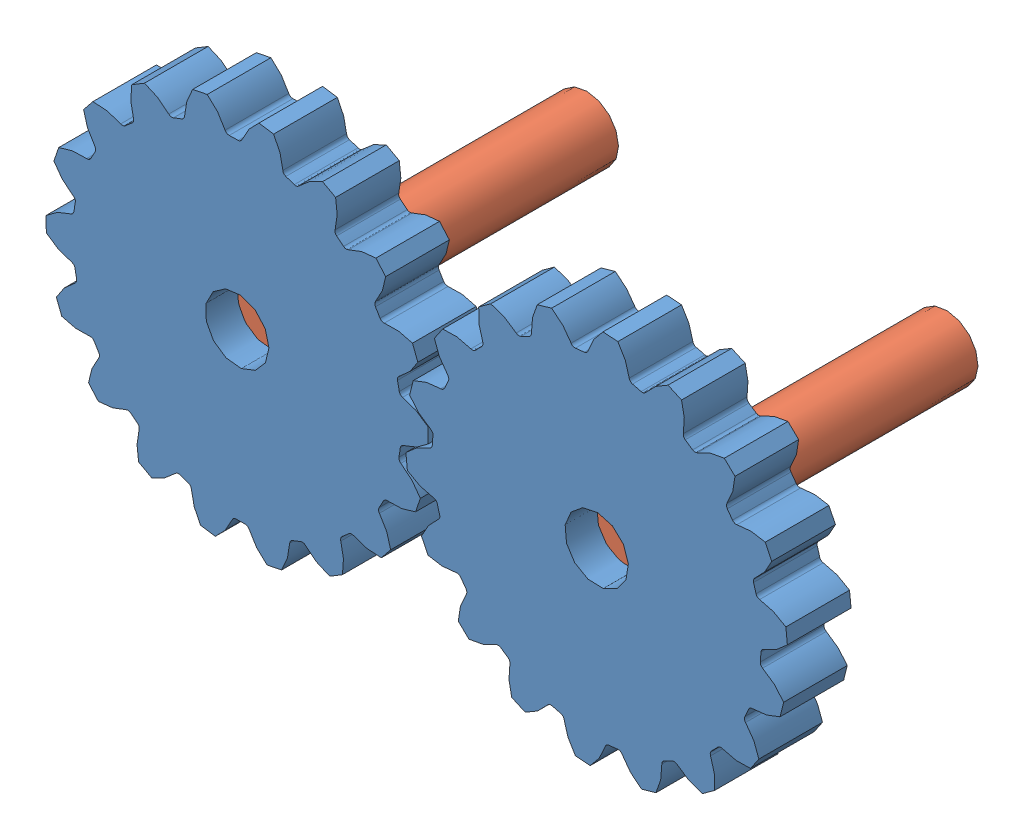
SolidWorks assembly gear train.SLDASM, configuration Default (file format 4400). Lengths in mm.
Overall size (405.51 239.98 164.72).
4 component instances, 2 part files, 5 mates.
Components (placement in the parent):
- gear-1: gear.SLDPRT [Default] x (-0.361887 0.932222 0) z (0 0 1) size (178.48 180 30)
- shaft-1: shaft.SLDPRT [Default] at origin size (30 30 149.72)
- gear-2: gear.SLDPRT [Default] at (169.4071 -4.6662 0) x (-0.436097 0.899899 0) z (0 0 1) size (178.48 180 30)
- shaft-2: shaft.SLDPRT [Default] at (169.4071 -4.6662 0) x (0.935478 0.353384 0) z (0 0 1) size (30 30 149.72)
Mates (geometry in assembly coordinates):
- Coincident6: coincident aligned: plane of gear-1; plane of assembly
- Coincident8: coincident aligned: plane of gear-2; plane of shaft-2
- Concentric1: concentric aligned: cylinder of gear-2 through (169.4071 -4.6662 -15) axis (0 0 1) radius 15; cylinder of shaft-2 through (169.4071 -4.6662 -149.7177) axis (0 0 1) radius 15
- Concentric2: concentric aligned: cylinder of gear-1 through (0 0 -15) axis (0 0 1) radius 15; cylinder of shaft-1 through (0 0 -149.7177) axis (0 0 1) radius 15
- GearMate3: gear = 1000 mm: cylinder of gear-1 through (0 0 -15) axis (0 0 1) radius 15; cylinder of gear-2 through (169.4071 -4.6662 -15) axis (0 0 1) radius 15
